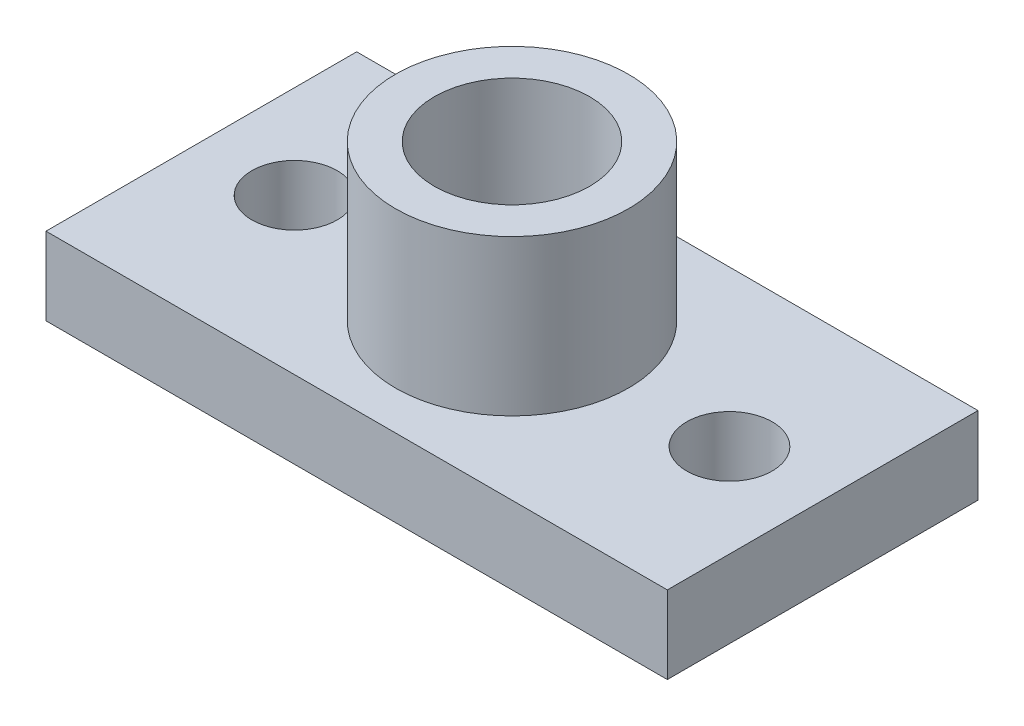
ISO-10303-21;
HEADER;
FILE_DESCRIPTION(('STEP AP214'),'2;1');
FILE_NAME('part.step','',(''),(''),'','','');
FILE_SCHEMA(('AUTOMOTIVE_DESIGN { 1 0 10303 214 1 1 1 1 }'));
ENDSEC;
DATA;
#1=APPLICATION_CONTEXT('core data for automotive mechanical design processes');
#2=APPLICATION_PROTOCOL_DEFINITION('international standard','automotive_design',2000,#1);
#3=PRODUCT_CONTEXT('',#1,'mechanical');
#4=PRODUCT('Part','Part','',(#3));
#5=PRODUCT_RELATED_PRODUCT_CATEGORY('part','',(#4));
#6=PRODUCT_DEFINITION_FORMATION('','',#4);
#7=PRODUCT_DEFINITION_CONTEXT('part definition',#1,'design');
#8=PRODUCT_DEFINITION('design','',#6,#7);
#9=PRODUCT_DEFINITION_SHAPE('','',#8);
#10=(LENGTH_UNIT() NAMED_UNIT(*) SI_UNIT(.MILLI.,.METRE.));
#11=(NAMED_UNIT(*) PLANE_ANGLE_UNIT() SI_UNIT($,.RADIAN.));
#12=(NAMED_UNIT(*) SI_UNIT($,.STERADIAN.) SOLID_ANGLE_UNIT());
#13=UNCERTAINTY_MEASURE_WITH_UNIT(LENGTH_MEASURE(1.E-05),#10,'distance_accuracy_value','');
#14=(GEOMETRIC_REPRESENTATION_CONTEXT(3) GLOBAL_UNCERTAINTY_ASSIGNED_CONTEXT((#13)) GLOBAL_UNIT_ASSIGNED_CONTEXT((#10,
#11,#12)) REPRESENTATION_CONTEXT('',''));
#15=CARTESIAN_POINT('',(0.,0.,0.));
#16=DIRECTION('',(0.,0.,1.));
#17=DIRECTION('',(1.,0.,0.));
#18=AXIS2_PLACEMENT_3D('',#15,#16,#17);
#19=CARTESIAN_POINT('',(-40.,10.,-20.));
#20=DIRECTION('',(1.,0.,0.));
#21=DIRECTION('',(0.,0.,-1.));
#22=AXIS2_PLACEMENT_3D('',#19,#20,#21);
#23=PLANE('',#22);
#24=DIRECTION('',(0.,0.,1.));
#25=VECTOR('',#24,1.);
#26=CARTESIAN_POINT('',(-40.,0.,-20.));
#27=LINE('',#26,#25);
#28=CARTESIAN_POINT('',(-40.,0.,-20.));
#29=VERTEX_POINT('',#28);
#30=CARTESIAN_POINT('',(-40.,0.,20.));
#31=VERTEX_POINT('',#30);
#32=EDGE_CURVE('E101',#29,#31,#27,.T.);
#33=ORIENTED_EDGE('',*,*,#32,.T.);
#34=DIRECTION('',(0.,-1.,0.));
#35=VECTOR('',#34,1.);
#36=CARTESIAN_POINT('',(-40.,10.,20.));
#37=LINE('',#36,#35);
#38=CARTESIAN_POINT('',(-40.,10.,20.));
#39=VERTEX_POINT('',#38);
#40=EDGE_CURVE('E11',#39,#31,#37,.T.);
#41=ORIENTED_EDGE('',*,*,#40,.F.);
#42=DIRECTION('',(0.,0.,1.));
#43=VECTOR('',#42,1.);
#44=CARTESIAN_POINT('',(-40.,10.,-20.));
#45=LINE('',#44,#43);
#46=CARTESIAN_POINT('',(-40.,10.,-20.));
#47=VERTEX_POINT('',#46);
#48=EDGE_CURVE('E88',#47,#39,#45,.T.);
#49=ORIENTED_EDGE('',*,*,#48,.F.);
#50=DIRECTION('',(0.,-1.,0.));
#51=VECTOR('',#50,1.);
#52=CARTESIAN_POINT('',(-40.,10.,-20.));
#53=LINE('',#52,#51);
#54=EDGE_CURVE('E97',#47,#29,#53,.T.);
#55=ORIENTED_EDGE('',*,*,#54,.T.);
#56=EDGE_LOOP('',(#33,#41,#49,#55));
#57=FACE_BOUND('',#56,.T.);
#58=ADVANCED_FACE('F35',(#57),#23,.F.);
#59=CARTESIAN_POINT('',(-40.,10.,20.));
#60=DIRECTION('',(0.,0.,-1.));
#61=DIRECTION('',(-1.,0.,0.));
#62=AXIS2_PLACEMENT_3D('',#59,#60,#61);
#63=PLANE('',#62);
#64=DIRECTION('',(1.,0.,0.));
#65=VECTOR('',#64,1.);
#66=CARTESIAN_POINT('',(-40.,0.,20.));
#67=LINE('',#66,#65);
#68=CARTESIAN_POINT('',(40.,0.,20.));
#69=VERTEX_POINT('',#68);
#70=EDGE_CURVE('E92',#31,#69,#67,.T.);
#71=ORIENTED_EDGE('',*,*,#70,.T.);
#72=DIRECTION('',(0.,-1.,0.));
#73=VECTOR('',#72,1.);
#74=CARTESIAN_POINT('',(40.,10.,20.));
#75=LINE('',#74,#73);
#76=CARTESIAN_POINT('',(40.,10.,20.));
#77=VERTEX_POINT('',#76);
#78=EDGE_CURVE('E44',#77,#69,#75,.T.);
#79=ORIENTED_EDGE('',*,*,#78,.F.);
#80=DIRECTION('',(1.,0.,0.));
#81=VECTOR('',#80,1.);
#82=CARTESIAN_POINT('',(-40.,10.,20.));
#83=LINE('',#82,#81);
#84=EDGE_CURVE('E83',#39,#77,#83,.T.);
#85=ORIENTED_EDGE('',*,*,#84,.F.);
#86=ORIENTED_EDGE('',*,*,#40,.T.);
#87=EDGE_LOOP('',(#71,#79,#85,#86));
#88=FACE_BOUND('',#87,.T.);
#89=ADVANCED_FACE('F91',(#88),#63,.F.);
#90=CARTESIAN_POINT('',(40.,10.,-20.));
#91=DIRECTION('',(-1.,0.,0.));
#92=DIRECTION('',(0.,0.,1.));
#93=AXIS2_PLACEMENT_3D('',#90,#91,#92);
#94=PLANE('',#93);
#95=DIRECTION('',(0.,0.,-1.));
#96=VECTOR('',#95,1.);
#97=CARTESIAN_POINT('',(40.,0.,-20.));
#98=LINE('',#97,#96);
#99=CARTESIAN_POINT('',(40.,0.,-20.));
#100=VERTEX_POINT('',#99);
#101=EDGE_CURVE('E70',#69,#100,#98,.T.);
#102=ORIENTED_EDGE('',*,*,#101,.T.);
#103=DIRECTION('',(0.,-1.,0.));
#104=VECTOR('',#103,1.);
#105=CARTESIAN_POINT('',(40.,10.,-20.));
#106=LINE('',#105,#104);
#107=CARTESIAN_POINT('',(40.,10.,-20.));
#108=VERTEX_POINT('',#107);
#109=EDGE_CURVE('E93',#108,#100,#106,.T.);
#110=ORIENTED_EDGE('',*,*,#109,.F.);
#111=DIRECTION('',(0.,0.,-1.));
#112=VECTOR('',#111,1.);
#113=CARTESIAN_POINT('',(40.,10.,-20.));
#114=LINE('',#113,#112);
#115=EDGE_CURVE('E86',#77,#108,#114,.T.);
#116=ORIENTED_EDGE('',*,*,#115,.F.);
#117=ORIENTED_EDGE('',*,*,#78,.T.);
#118=EDGE_LOOP('',(#102,#110,#116,#117));
#119=FACE_BOUND('',#118,.T.);
#120=ADVANCED_FACE('F95',(#119),#94,.F.);
#121=CARTESIAN_POINT('',(-40.,10.,-20.));
#122=DIRECTION('',(0.,0.,1.));
#123=DIRECTION('',(1.,0.,0.));
#124=AXIS2_PLACEMENT_3D('',#121,#122,#123);
#125=PLANE('',#124);
#126=DIRECTION('',(-1.,0.,0.));
#127=VECTOR('',#126,1.);
#128=CARTESIAN_POINT('',(-40.,0.,-20.));
#129=LINE('',#128,#127);
#130=EDGE_CURVE('E76',#100,#29,#129,.T.);
#131=ORIENTED_EDGE('',*,*,#130,.T.);
#132=ORIENTED_EDGE('',*,*,#54,.F.);
#133=DIRECTION('',(-1.,0.,0.));
#134=VECTOR('',#133,1.);
#135=CARTESIAN_POINT('',(-40.,10.,-20.));
#136=LINE('',#135,#134);
#137=EDGE_CURVE('E53',#108,#47,#136,.T.);
#138=ORIENTED_EDGE('',*,*,#137,.F.);
#139=ORIENTED_EDGE('',*,*,#109,.T.);
#140=EDGE_LOOP('',(#131,#132,#138,#139));
#141=FACE_BOUND('',#140,.T.);
#142=ADVANCED_FACE('F138',(#141),#125,.F.);
#143=CARTESIAN_POINT('',(0.,10.,0.));
#144=DIRECTION('',(0.,1.,0.));
#145=DIRECTION('',(0.,0.,1.));
#146=AXIS2_PLACEMENT_3D('',#143,#144,#145);
#147=PLANE('',#146);
#148=CARTESIAN_POINT('',(28.,10.,0.));
#149=DIRECTION('',(0.,1.,0.));
#150=DIRECTION('',(0.,0.,1.));
#151=AXIS2_PLACEMENT_3D('',#148,#149,#150);
#152=CIRCLE('',#151,5.49999999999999);
#153=CARTESIAN_POINT('',(28.,10.,5.49999999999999));
#154=VERTEX_POINT('',#153);
#155=EDGE_CURVE('E123',#154,#154,#152,.T.);
#156=ORIENTED_EDGE('',*,*,#155,.F.);
#157=EDGE_LOOP('',(#156));
#158=FACE_BOUND('',#157,.T.);
#159=CARTESIAN_POINT('',(-28.,10.,0.));
#160=DIRECTION('',(0.,1.,0.));
#161=DIRECTION('',(0.,0.,1.));
#162=AXIS2_PLACEMENT_3D('',#159,#160,#161);
#163=CIRCLE('',#162,5.5);
#164=CARTESIAN_POINT('',(-28.,10.,5.5));
#165=VERTEX_POINT('',#164);
#166=EDGE_CURVE('E112',#165,#165,#163,.T.);
#167=ORIENTED_EDGE('',*,*,#166,.F.);
#168=EDGE_LOOP('',(#167));
#169=FACE_BOUND('',#168,.T.);
#170=CARTESIAN_POINT('',(0.,10.,0.));
#171=DIRECTION('',(0.,1.,0.));
#172=DIRECTION('',(0.,0.,1.));
#173=AXIS2_PLACEMENT_3D('',#170,#171,#172);
#174=CIRCLE('',#173,15.);
#175=CARTESIAN_POINT('',(0.,10.,15.));
#176=VERTEX_POINT('',#175);
#177=EDGE_CURVE('E128',#176,#176,#174,.T.);
#178=ORIENTED_EDGE('',*,*,#177,.F.);
#179=EDGE_LOOP('',(#178));
#180=FACE_BOUND('',#179,.T.);
#181=ORIENTED_EDGE('',*,*,#48,.T.);
#182=ORIENTED_EDGE('',*,*,#84,.T.);
#183=ORIENTED_EDGE('',*,*,#115,.T.);
#184=ORIENTED_EDGE('',*,*,#137,.T.);
#185=EDGE_LOOP('',(#181,#182,#183,#184));
#186=FACE_BOUND('',#185,.T.);
#187=ADVANCED_FACE('F84',(#158,#169,#180,#186),#147,.T.);
#188=CARTESIAN_POINT('',(0.,0.,0.));
#189=DIRECTION('',(0.,1.,0.));
#190=DIRECTION('',(0.,0.,1.));
#191=AXIS2_PLACEMENT_3D('',#188,#189,#190);
#192=PLANE('',#191);
#193=CARTESIAN_POINT('',(28.,0.,0.));
#194=DIRECTION('',(0.,1.,0.));
#195=DIRECTION('',(0.,0.,1.));
#196=AXIS2_PLACEMENT_3D('',#193,#194,#195);
#197=CIRCLE('',#196,5.49999999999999);
#198=CARTESIAN_POINT('',(28.,0.,5.49999999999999));
#199=VERTEX_POINT('',#198);
#200=EDGE_CURVE('E38',#199,#199,#197,.T.);
#201=ORIENTED_EDGE('',*,*,#200,.T.);
#202=EDGE_LOOP('',(#201));
#203=FACE_BOUND('',#202,.T.);
#204=CARTESIAN_POINT('',(-28.,0.,0.));
#205=DIRECTION('',(0.,1.,0.));
#206=DIRECTION('',(0.,0.,1.));
#207=AXIS2_PLACEMENT_3D('',#204,#205,#206);
#208=CIRCLE('',#207,5.5);
#209=CARTESIAN_POINT('',(-28.,0.,5.5));
#210=VERTEX_POINT('',#209);
#211=EDGE_CURVE('E109',#210,#210,#208,.T.);
#212=ORIENTED_EDGE('',*,*,#211,.T.);
#213=EDGE_LOOP('',(#212));
#214=FACE_BOUND('',#213,.T.);
#215=CARTESIAN_POINT('',(0.,0.,0.));
#216=DIRECTION('',(0.,1.,0.));
#217=DIRECTION('',(0.,0.,1.));
#218=AXIS2_PLACEMENT_3D('',#215,#216,#217);
#219=CIRCLE('',#218,10.);
#220=CARTESIAN_POINT('',(0.,0.,10.));
#221=VERTEX_POINT('',#220);
#222=EDGE_CURVE('E116',#221,#221,#219,.T.);
#223=ORIENTED_EDGE('',*,*,#222,.T.);
#224=EDGE_LOOP('',(#223));
#225=FACE_BOUND('',#224,.T.);
#226=ORIENTED_EDGE('',*,*,#32,.F.);
#227=ORIENTED_EDGE('',*,*,#130,.F.);
#228=ORIENTED_EDGE('',*,*,#101,.F.);
#229=ORIENTED_EDGE('',*,*,#70,.F.);
#230=EDGE_LOOP('',(#226,#227,#228,#229));
#231=FACE_BOUND('',#230,.T.);
#232=ADVANCED_FACE('F137',(#203,#214,#225,#231),#192,.F.);
#233=CARTESIAN_POINT('',(0.,30.,0.));
#234=DIRECTION('',(0.,-1.,0.));
#235=DIRECTION('',(0.,0.,-1.));
#236=AXIS2_PLACEMENT_3D('',#233,#234,#235);
#237=CYLINDRICAL_SURFACE('',#236,15.);
#238=CARTESIAN_POINT('',(0.,30.,0.));
#239=DIRECTION('',(0.,1.,0.));
#240=DIRECTION('',(0.,0.,1.));
#241=AXIS2_PLACEMENT_3D('',#238,#239,#240);
#242=CIRCLE('',#241,15.);
#243=CARTESIAN_POINT('',(0.,30.,15.));
#244=VERTEX_POINT('',#243);
#245=EDGE_CURVE('E104',#244,#244,#242,.T.);
#246=ORIENTED_EDGE('',*,*,#245,.F.);
#247=EDGE_LOOP('',(#246));
#248=FACE_BOUND('',#247,.T.);
#249=ORIENTED_EDGE('',*,*,#177,.T.);
#250=EDGE_LOOP('',(#249));
#251=FACE_BOUND('',#250,.T.);
#252=ADVANCED_FACE('F134',(#248,#251),#237,.T.);
#253=CARTESIAN_POINT('',(0.,30.,0.));
#254=DIRECTION('',(0.,1.,0.));
#255=DIRECTION('',(0.,0.,1.));
#256=AXIS2_PLACEMENT_3D('',#253,#254,#255);
#257=PLANE('',#256);
#258=CARTESIAN_POINT('',(0.,30.,0.));
#259=DIRECTION('',(0.,1.,0.));
#260=DIRECTION('',(0.,0.,1.));
#261=AXIS2_PLACEMENT_3D('',#258,#259,#260);
#262=CIRCLE('',#261,10.);
#263=CARTESIAN_POINT('',(0.,30.,10.));
#264=VERTEX_POINT('',#263);
#265=EDGE_CURVE('E111',#264,#264,#262,.T.);
#266=ORIENTED_EDGE('',*,*,#265,.F.);
#267=EDGE_LOOP('',(#266));
#268=FACE_BOUND('',#267,.T.);
#269=ORIENTED_EDGE('',*,*,#245,.T.);
#270=EDGE_LOOP('',(#269));
#271=FACE_BOUND('',#270,.T.);
#272=ADVANCED_FACE('F179',(#268,#271),#257,.T.);
#273=CARTESIAN_POINT('',(0.,-15.,0.));
#274=DIRECTION('',(0.,1.,0.));
#275=DIRECTION('',(0.,0.,1.));
#276=AXIS2_PLACEMENT_3D('',#273,#274,#275);
#277=CYLINDRICAL_SURFACE('',#276,10.);
#278=ORIENTED_EDGE('',*,*,#265,.T.);
#279=EDGE_LOOP('',(#278));
#280=FACE_BOUND('',#279,.T.);
#281=ORIENTED_EDGE('',*,*,#222,.F.);
#282=EDGE_LOOP('',(#281));
#283=FACE_BOUND('',#282,.T.);
#284=ADVANCED_FACE('F189',(#280,#283),#277,.F.);
#285=CARTESIAN_POINT('',(-28.,-35.,0.));
#286=DIRECTION('',(0.,1.,0.));
#287=DIRECTION('',(0.,0.,1.));
#288=AXIS2_PLACEMENT_3D('',#285,#286,#287);
#289=CYLINDRICAL_SURFACE('',#288,5.5);
#290=ORIENTED_EDGE('',*,*,#166,.T.);
#291=EDGE_LOOP('',(#290));
#292=FACE_BOUND('',#291,.T.);
#293=ORIENTED_EDGE('',*,*,#211,.F.);
#294=EDGE_LOOP('',(#293));
#295=FACE_BOUND('',#294,.T.);
#296=ADVANCED_FACE('F198',(#292,#295),#289,.F.);
#297=CARTESIAN_POINT('',(28.,-35.,0.));
#298=DIRECTION('',(0.,1.,0.));
#299=DIRECTION('',(0.,0.,1.));
#300=AXIS2_PLACEMENT_3D('',#297,#298,#299);
#301=CYLINDRICAL_SURFACE('',#300,5.49999999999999);
#302=ORIENTED_EDGE('',*,*,#155,.T.);
#303=EDGE_LOOP('',(#302));
#304=FACE_BOUND('',#303,.T.);
#305=ORIENTED_EDGE('',*,*,#200,.F.);
#306=EDGE_LOOP('',(#305));
#307=FACE_BOUND('',#306,.T.);
#308=ADVANCED_FACE('F217',(#304,#307),#301,.F.);
#309=CLOSED_SHELL('',(#58,#89,#120,#142,#187,#232,#252,#272,#284,#296,#308));
#310=MANIFOLD_SOLID_BREP('B2',#309);
#311=ADVANCED_BREP_SHAPE_REPRESENTATION('',(#18,#310),#14);
#312=SHAPE_DEFINITION_REPRESENTATION(#9,#311);
ENDSEC;
END-ISO-10303-21;
